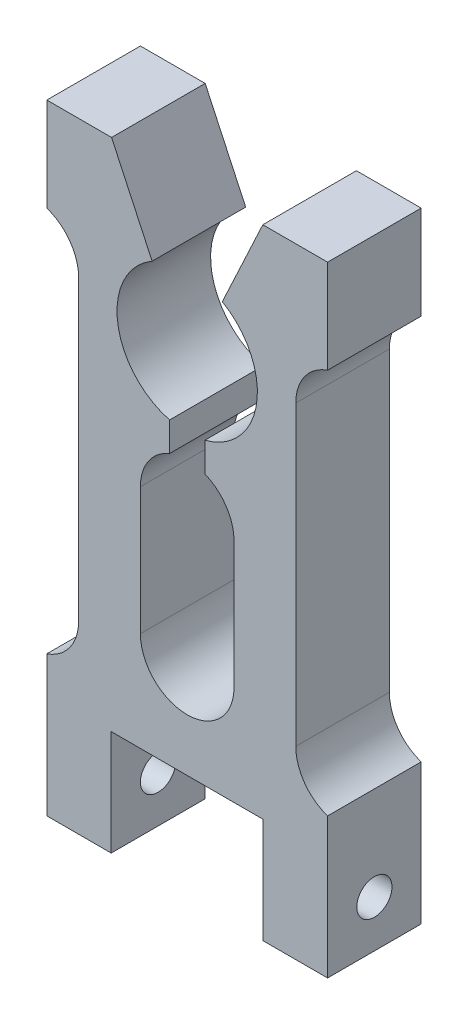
ISO-10303-21;
HEADER;
FILE_DESCRIPTION(('STEP AP214'),'2;1');
FILE_NAME('part.step','',(''),(''),'','','');
FILE_SCHEMA(('AUTOMOTIVE_DESIGN { 1 0 10303 214 1 1 1 1 }'));
ENDSEC;
DATA;
#1=APPLICATION_CONTEXT('core data for automotive mechanical design processes');
#2=APPLICATION_PROTOCOL_DEFINITION('international standard','automotive_design',2000,#1);
#3=PRODUCT_CONTEXT('',#1,'mechanical');
#4=PRODUCT('Part','Part','',(#3));
#5=PRODUCT_RELATED_PRODUCT_CATEGORY('part','',(#4));
#6=PRODUCT_DEFINITION_FORMATION('','',#4);
#7=PRODUCT_DEFINITION_CONTEXT('part definition',#1,'design');
#8=PRODUCT_DEFINITION('design','',#6,#7);
#9=PRODUCT_DEFINITION_SHAPE('','',#8);
#10=(LENGTH_UNIT() NAMED_UNIT(*) SI_UNIT(.MILLI.,.METRE.));
#11=(NAMED_UNIT(*) PLANE_ANGLE_UNIT() SI_UNIT($,.RADIAN.));
#12=(NAMED_UNIT(*) SI_UNIT($,.STERADIAN.) SOLID_ANGLE_UNIT());
#13=UNCERTAINTY_MEASURE_WITH_UNIT(LENGTH_MEASURE(1.E-05),#10,'distance_accuracy_value','');
#14=(GEOMETRIC_REPRESENTATION_CONTEXT(3) GLOBAL_UNCERTAINTY_ASSIGNED_CONTEXT((#13)) GLOBAL_UNIT_ASSIGNED_CONTEXT((#10,
#11,#12)) REPRESENTATION_CONTEXT('',''));
#15=CARTESIAN_POINT('',(0.,0.,0.));
#16=DIRECTION('',(0.,0.,1.));
#17=DIRECTION('',(1.,0.,0.));
#18=AXIS2_PLACEMENT_3D('',#15,#16,#17);
#19=CARTESIAN_POINT('',(-10.3124,-64.0842,6.35));
#20=DIRECTION('',(-1.,0.,0.));
#21=DIRECTION('',(0.,0.,1.));
#22=AXIS2_PLACEMENT_3D('',#19,#20,#21);
#23=PLANE('',#22);
#24=CARTESIAN_POINT('',(-10.3124,-57.7342,0.));
#25=DIRECTION('',(-1.,0.,0.));
#26=DIRECTION('',(0.,0.,1.));
#27=AXIS2_PLACEMENT_3D('',#24,#25,#26);
#28=CIRCLE('',#27,2.3876);
#29=CARTESIAN_POINT('',(-10.3124,-57.7342,-2.3876));
#30=VERTEX_POINT('',#29);
#31=EDGE_CURVE('E253',#30,#30,#28,.T.);
#32=ORIENTED_EDGE('',*,*,#31,.T.);
#33=EDGE_LOOP('',(#32));
#34=FACE_BOUND('',#33,.T.);
#35=DIRECTION('',(0.,1.,0.));
#36=VECTOR('',#35,1.);
#37=CARTESIAN_POINT('',(-10.3124,-64.0842,-6.35));
#38=LINE('',#37,#36);
#39=CARTESIAN_POINT('',(-10.3124,-64.0842,-6.35));
#40=VERTEX_POINT('',#39);
#41=CARTESIAN_POINT('',(-10.3124,-49.8094,-6.35));
#42=VERTEX_POINT('',#41);
#43=EDGE_CURVE('E249',#40,#42,#38,.T.);
#44=ORIENTED_EDGE('',*,*,#43,.T.);
#45=DIRECTION('',(0.,0.,-1.));
#46=VECTOR('',#45,1.);
#47=CARTESIAN_POINT('',(-10.3124,-49.8094,6.35));
#48=LINE('',#47,#46);
#49=CARTESIAN_POINT('',(-10.3124,-49.8094,6.35));
#50=VERTEX_POINT('',#49);
#51=EDGE_CURVE('E11',#50,#42,#48,.T.);
#52=ORIENTED_EDGE('',*,*,#51,.F.);
#53=DIRECTION('',(0.,1.,0.));
#54=VECTOR('',#53,1.);
#55=CARTESIAN_POINT('',(-10.3124,-64.0842,6.35));
#56=LINE('',#55,#54);
#57=CARTESIAN_POINT('',(-10.3124,-64.0842,6.35));
#58=VERTEX_POINT('',#57);
#59=EDGE_CURVE('E304',#58,#50,#56,.T.);
#60=ORIENTED_EDGE('',*,*,#59,.F.);
#61=DIRECTION('',(0.,0.,-1.));
#62=VECTOR('',#61,1.);
#63=CARTESIAN_POINT('',(-10.3124,-64.0842,6.35));
#64=LINE('',#63,#62);
#65=EDGE_CURVE('E245',#58,#40,#64,.T.);
#66=ORIENTED_EDGE('',*,*,#65,.T.);
#67=EDGE_LOOP('',(#44,#52,#60,#66));
#68=FACE_BOUND('',#67,.T.);
#69=ADVANCED_FACE('F32',(#34,#68),#23,.F.);
#70=CARTESIAN_POINT('',(-10.3124,-49.8094,6.35));
#71=DIRECTION('',(0.,1.,0.));
#72=DIRECTION('',(0.,0.,1.));
#73=AXIS2_PLACEMENT_3D('',#70,#71,#72);
#74=PLANE('',#73);
#75=DIRECTION('',(1.,0.,0.));
#76=VECTOR('',#75,1.);
#77=CARTESIAN_POINT('',(-10.3124,-49.8094,-6.35));
#78=LINE('',#77,#76);
#79=CARTESIAN_POINT('',(10.3124,-49.8094,-6.35));
#80=VERTEX_POINT('',#79);
#81=EDGE_CURVE('E252',#42,#80,#78,.T.);
#82=ORIENTED_EDGE('',*,*,#81,.T.);
#83=DIRECTION('',(0.,0.,-1.));
#84=VECTOR('',#83,1.);
#85=CARTESIAN_POINT('',(10.3124,-49.8094,6.35));
#86=LINE('',#85,#84);
#87=CARTESIAN_POINT('',(10.3124,-49.8094,6.35));
#88=VERTEX_POINT('',#87);
#89=EDGE_CURVE('E41',#88,#80,#86,.T.);
#90=ORIENTED_EDGE('',*,*,#89,.F.);
#91=DIRECTION('',(1.,0.,0.));
#92=VECTOR('',#91,1.);
#93=CARTESIAN_POINT('',(-10.3124,-49.8094,6.35));
#94=LINE('',#93,#92);
#95=EDGE_CURVE('E152',#50,#88,#94,.T.);
#96=ORIENTED_EDGE('',*,*,#95,.F.);
#97=ORIENTED_EDGE('',*,*,#51,.T.);
#98=EDGE_LOOP('',(#82,#90,#96,#97));
#99=FACE_BOUND('',#98,.T.);
#100=ADVANCED_FACE('F464',(#99),#74,.F.);
#101=CARTESIAN_POINT('',(10.3124,-49.8094,6.35));
#102=DIRECTION('',(1.,0.,0.));
#103=DIRECTION('',(0.,0.,-1.));
#104=AXIS2_PLACEMENT_3D('',#101,#102,#103);
#105=PLANE('',#104);
#106=CARTESIAN_POINT('',(10.3124,-57.7342,0.));
#107=DIRECTION('',(1.,0.,0.));
#108=DIRECTION('',(0.,0.,-1.));
#109=AXIS2_PLACEMENT_3D('',#106,#107,#108);
#110=CIRCLE('',#109,2.3876);
#111=CARTESIAN_POINT('',(10.3124,-57.7342,-2.3876));
#112=VERTEX_POINT('',#111);
#113=EDGE_CURVE('E472',#112,#112,#110,.T.);
#114=ORIENTED_EDGE('',*,*,#113,.T.);
#115=EDGE_LOOP('',(#114));
#116=FACE_BOUND('',#115,.T.);
#117=DIRECTION('',(0.,-1.,0.));
#118=VECTOR('',#117,1.);
#119=CARTESIAN_POINT('',(10.3124,-49.8094,-6.35));
#120=LINE('',#119,#118);
#121=CARTESIAN_POINT('',(10.3124,-64.0842,-6.35));
#122=VERTEX_POINT('',#121);
#123=EDGE_CURVE('E255',#80,#122,#120,.T.);
#124=ORIENTED_EDGE('',*,*,#123,.T.);
#125=DIRECTION('',(0.,0.,-1.));
#126=VECTOR('',#125,1.);
#127=CARTESIAN_POINT('',(10.3124,-64.0842,6.35));
#128=LINE('',#127,#126);
#129=CARTESIAN_POINT('',(10.3124,-64.0842,6.35));
#130=VERTEX_POINT('',#129);
#131=EDGE_CURVE('E371',#130,#122,#128,.T.);
#132=ORIENTED_EDGE('',*,*,#131,.F.);
#133=DIRECTION('',(0.,-1.,0.));
#134=VECTOR('',#133,1.);
#135=CARTESIAN_POINT('',(10.3124,-49.8094,6.35));
#136=LINE('',#135,#134);
#137=EDGE_CURVE('E380',#88,#130,#136,.T.);
#138=ORIENTED_EDGE('',*,*,#137,.F.);
#139=ORIENTED_EDGE('',*,*,#89,.T.);
#140=EDGE_LOOP('',(#124,#132,#138,#139));
#141=FACE_BOUND('',#140,.T.);
#142=ADVANCED_FACE('F378',(#116,#141),#105,.F.);
#143=CARTESIAN_POINT('',(10.3124,-64.0842,6.35));
#144=DIRECTION('',(0.,1.,0.));
#145=DIRECTION('',(0.,0.,1.));
#146=AXIS2_PLACEMENT_3D('',#143,#144,#145);
#147=PLANE('',#146);
#148=DIRECTION('',(1.,0.,0.));
#149=VECTOR('',#148,1.);
#150=CARTESIAN_POINT('',(10.3124,-64.0842,-6.35));
#151=LINE('',#150,#149);
#152=CARTESIAN_POINT('',(19.05,-64.0842,-6.35));
#153=VERTEX_POINT('',#152);
#154=EDGE_CURVE('E257',#122,#153,#151,.T.);
#155=ORIENTED_EDGE('',*,*,#154,.T.);
#156=DIRECTION('',(0.,0.,-1.));
#157=VECTOR('',#156,1.);
#158=CARTESIAN_POINT('',(19.05,-64.0842,6.35));
#159=LINE('',#158,#157);
#160=CARTESIAN_POINT('',(19.05,-64.0842,6.35));
#161=VERTEX_POINT('',#160);
#162=EDGE_CURVE('E368',#161,#153,#159,.T.);
#163=ORIENTED_EDGE('',*,*,#162,.F.);
#164=DIRECTION('',(1.,0.,0.));
#165=VECTOR('',#164,1.);
#166=CARTESIAN_POINT('',(10.3124,-64.0842,6.35));
#167=LINE('',#166,#165);
#168=EDGE_CURVE('E398',#130,#161,#167,.T.);
#169=ORIENTED_EDGE('',*,*,#168,.F.);
#170=ORIENTED_EDGE('',*,*,#131,.T.);
#171=EDGE_LOOP('',(#155,#163,#169,#170));
#172=FACE_BOUND('',#171,.T.);
#173=ADVANCED_FACE('F389',(#172),#147,.F.);
#174=CARTESIAN_POINT('',(19.05,-45.0342,6.35));
#175=DIRECTION('',(-1.,0.,0.));
#176=DIRECTION('',(0.,0.,1.));
#177=AXIS2_PLACEMENT_3D('',#174,#175,#176);
#178=PLANE('',#177);
#179=CARTESIAN_POINT('',(19.05,-57.7342,0.));
#180=DIRECTION('',(-1.,0.,0.));
#181=DIRECTION('',(0.,0.,1.));
#182=AXIS2_PLACEMENT_3D('',#179,#180,#181);
#183=CIRCLE('',#182,2.3876);
#184=CARTESIAN_POINT('',(19.05,-57.7342,-2.3876));
#185=VERTEX_POINT('',#184);
#186=EDGE_CURVE('E475',#185,#185,#183,.T.);
#187=ORIENTED_EDGE('',*,*,#186,.T.);
#188=EDGE_LOOP('',(#187));
#189=FACE_BOUND('',#188,.T.);
#190=DIRECTION('',(0.,1.,0.));
#191=VECTOR('',#190,1.);
#192=CARTESIAN_POINT('',(19.05,-45.0342,-6.35));
#193=LINE('',#192,#191);
#194=CARTESIAN_POINT('',(19.05,-45.0342,-6.35));
#195=VERTEX_POINT('',#194);
#196=EDGE_CURVE('E259',#153,#195,#193,.T.);
#197=ORIENTED_EDGE('',*,*,#196,.T.);
#198=DIRECTION('',(0.,0.,-1.));
#199=VECTOR('',#198,1.);
#200=CARTESIAN_POINT('',(19.05,-45.0342,6.35));
#201=LINE('',#200,#199);
#202=CARTESIAN_POINT('',(19.05,-45.0342,6.35));
#203=VERTEX_POINT('',#202);
#204=EDGE_CURVE('E365',#203,#195,#201,.T.);
#205=ORIENTED_EDGE('',*,*,#204,.F.);
#206=DIRECTION('',(0.,1.,0.));
#207=VECTOR('',#206,1.);
#208=CARTESIAN_POINT('',(19.05,-45.0342,6.35));
#209=LINE('',#208,#207);
#210=EDGE_CURVE('E395',#161,#203,#209,.T.);
#211=ORIENTED_EDGE('',*,*,#210,.F.);
#212=ORIENTED_EDGE('',*,*,#162,.T.);
#213=EDGE_LOOP('',(#197,#205,#211,#212));
#214=FACE_BOUND('',#213,.T.);
#215=ADVANCED_FACE('F393',(#189,#214),#178,.F.);
#216=CARTESIAN_POINT('',(21.082,-39.0180986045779,6.35));
#217=DIRECTION('',(0.,0.,-1.));
#218=DIRECTION('',(-1.,0.,0.));
#219=AXIS2_PLACEMENT_3D('',#216,#217,#218);
#220=CYLINDRICAL_SURFACE('',#219,6.35);
#221=CARTESIAN_POINT('',(21.082,-39.0180986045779,-6.35));
#222=DIRECTION('',(0.,0.,-1.));
#223=DIRECTION('',(1.,0.,0.));
#224=AXIS2_PLACEMENT_3D('',#221,#222,#223);
#225=CIRCLE('',#224,6.35);
#226=CARTESIAN_POINT('',(14.732,-39.0180986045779,-6.35));
#227=VERTEX_POINT('',#226);
#228=EDGE_CURVE('E261',#195,#227,#225,.T.);
#229=ORIENTED_EDGE('',*,*,#228,.T.);
#230=DIRECTION('',(0.,0.,-1.));
#231=VECTOR('',#230,1.);
#232=CARTESIAN_POINT('',(14.732,-39.0180986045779,6.35));
#233=LINE('',#232,#231);
#234=CARTESIAN_POINT('',(14.732,-39.0180986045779,6.35));
#235=VERTEX_POINT('',#234);
#236=EDGE_CURVE('E362',#235,#227,#233,.T.);
#237=ORIENTED_EDGE('',*,*,#236,.F.);
#238=CARTESIAN_POINT('',(21.082,-39.0180986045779,6.35));
#239=DIRECTION('',(0.,0.,-1.));
#240=DIRECTION('',(1.,0.,0.));
#241=AXIS2_PLACEMENT_3D('',#238,#239,#240);
#242=CIRCLE('',#241,6.35);
#243=EDGE_CURVE('E397',#203,#235,#242,.T.);
#244=ORIENTED_EDGE('',*,*,#243,.F.);
#245=ORIENTED_EDGE('',*,*,#204,.T.);
#246=EDGE_LOOP('',(#229,#237,#244,#245));
#247=FACE_BOUND('',#246,.T.);
#248=ADVANCED_FACE('F700',(#247),#220,.F.);
#249=CARTESIAN_POINT('',(14.732,1.32449860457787,6.35));
#250=DIRECTION('',(-1.,0.,0.));
#251=DIRECTION('',(0.,-1.,0.));
#252=AXIS2_PLACEMENT_3D('',#249,#250,#251);
#253=PLANE('',#252);
#254=DIRECTION('',(0.,1.,0.));
#255=VECTOR('',#254,1.);
#256=CARTESIAN_POINT('',(14.732,1.32449860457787,-6.35));
#257=LINE('',#256,#255);
#258=CARTESIAN_POINT('',(14.732,1.32449860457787,-6.35));
#259=VERTEX_POINT('',#258);
#260=EDGE_CURVE('E263',#227,#259,#257,.T.);
#261=ORIENTED_EDGE('',*,*,#260,.T.);
#262=DIRECTION('',(0.,0.,-1.));
#263=VECTOR('',#262,1.);
#264=CARTESIAN_POINT('',(14.732,1.32449860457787,6.35));
#265=LINE('',#264,#263);
#266=CARTESIAN_POINT('',(14.732,1.32449860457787,6.35));
#267=VERTEX_POINT('',#266);
#268=EDGE_CURVE('E359',#267,#259,#265,.T.);
#269=ORIENTED_EDGE('',*,*,#268,.F.);
#270=DIRECTION('',(0.,1.,0.));
#271=VECTOR('',#270,1.);
#272=CARTESIAN_POINT('',(14.732,1.32449860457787,6.35));
#273=LINE('',#272,#271);
#274=EDGE_CURVE('E400',#235,#267,#273,.T.);
#275=ORIENTED_EDGE('',*,*,#274,.F.);
#276=ORIENTED_EDGE('',*,*,#236,.T.);
#277=EDGE_LOOP('',(#261,#269,#275,#276));
#278=FACE_BOUND('',#277,.T.);
#279=ADVANCED_FACE('F690',(#278),#253,.F.);
#280=CARTESIAN_POINT('',(21.082,1.32449860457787,6.35));
#281=DIRECTION('',(0.,0.,-1.));
#282=DIRECTION('',(-1.,0.,0.));
#283=AXIS2_PLACEMENT_3D('',#280,#281,#282);
#284=CYLINDRICAL_SURFACE('',#283,6.35);
#285=CARTESIAN_POINT('',(21.082,1.32449860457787,-6.35));
#286=DIRECTION('',(0.,0.,-1.));
#287=DIRECTION('',(1.,0.,0.));
#288=AXIS2_PLACEMENT_3D('',#285,#286,#287);
#289=CIRCLE('',#288,6.35);
#290=CARTESIAN_POINT('',(19.05,7.34059999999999,-6.35));
#291=VERTEX_POINT('',#290);
#292=EDGE_CURVE('E265',#259,#291,#289,.T.);
#293=ORIENTED_EDGE('',*,*,#292,.T.);
#294=DIRECTION('',(0.,0.,-1.));
#295=VECTOR('',#294,1.);
#296=CARTESIAN_POINT('',(19.05,7.34059999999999,6.35));
#297=LINE('',#296,#295);
#298=CARTESIAN_POINT('',(19.05,7.34059999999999,6.35));
#299=VERTEX_POINT('',#298);
#300=EDGE_CURVE('E356',#299,#291,#297,.T.);
#301=ORIENTED_EDGE('',*,*,#300,.F.);
#302=CARTESIAN_POINT('',(21.082,1.32449860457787,6.35));
#303=DIRECTION('',(0.,0.,-1.));
#304=DIRECTION('',(1.,0.,0.));
#305=AXIS2_PLACEMENT_3D('',#302,#303,#304);
#306=CIRCLE('',#305,6.35);
#307=EDGE_CURVE('E406',#267,#299,#306,.T.);
#308=ORIENTED_EDGE('',*,*,#307,.F.);
#309=ORIENTED_EDGE('',*,*,#268,.T.);
#310=EDGE_LOOP('',(#293,#301,#308,#309));
#311=FACE_BOUND('',#310,.T.);
#312=ADVANCED_FACE('F680',(#311),#284,.F.);
#313=CARTESIAN_POINT('',(19.05,20.0406,6.35));
#314=DIRECTION('',(-1.,0.,0.));
#315=DIRECTION('',(0.,-1.,0.));
#316=AXIS2_PLACEMENT_3D('',#313,#314,#315);
#317=PLANE('',#316);
#318=DIRECTION('',(0.,1.,0.));
#319=VECTOR('',#318,1.);
#320=CARTESIAN_POINT('',(19.05,20.0406,-6.35));
#321=LINE('',#320,#319);
#322=CARTESIAN_POINT('',(19.05,20.0406,-6.35));
#323=VERTEX_POINT('',#322);
#324=EDGE_CURVE('E267',#291,#323,#321,.T.);
#325=ORIENTED_EDGE('',*,*,#324,.T.);
#326=DIRECTION('',(0.,0.,-1.));
#327=VECTOR('',#326,1.);
#328=CARTESIAN_POINT('',(19.05,20.0406,6.35));
#329=LINE('',#328,#327);
#330=CARTESIAN_POINT('',(19.05,20.0406,6.35));
#331=VERTEX_POINT('',#330);
#332=EDGE_CURVE('E353',#331,#323,#329,.T.);
#333=ORIENTED_EDGE('',*,*,#332,.F.);
#334=DIRECTION('',(0.,1.,0.));
#335=VECTOR('',#334,1.);
#336=CARTESIAN_POINT('',(19.05,20.0406,6.35));
#337=LINE('',#336,#335);
#338=EDGE_CURVE('E408',#299,#331,#337,.T.);
#339=ORIENTED_EDGE('',*,*,#338,.F.);
#340=ORIENTED_EDGE('',*,*,#300,.T.);
#341=EDGE_LOOP('',(#325,#333,#339,#340));
#342=FACE_BOUND('',#341,.T.);
#343=ADVANCED_FACE('F670',(#342),#317,.F.);
#344=CARTESIAN_POINT('',(10.2610637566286,20.0406,6.35));
#345=DIRECTION('',(0.,-1.,0.));
#346=DIRECTION('',(1.,0.,0.));
#347=AXIS2_PLACEMENT_3D('',#344,#345,#346);
#348=PLANE('',#347);
#349=DIRECTION('',(-1.,0.,0.));
#350=VECTOR('',#349,1.);
#351=CARTESIAN_POINT('',(10.2610637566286,20.0406,-6.35));
#352=LINE('',#351,#350);
#353=CARTESIAN_POINT('',(10.2610637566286,20.0406,-6.35));
#354=VERTEX_POINT('',#353);
#355=EDGE_CURVE('E269',#323,#354,#352,.T.);
#356=ORIENTED_EDGE('',*,*,#355,.T.);
#357=DIRECTION('',(0.,0.,-1.));
#358=VECTOR('',#357,1.);
#359=CARTESIAN_POINT('',(10.2610637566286,20.0406,6.35));
#360=LINE('',#359,#358);
#361=CARTESIAN_POINT('',(10.2610637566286,20.0406,6.35));
#362=VERTEX_POINT('',#361);
#363=EDGE_CURVE('E350',#362,#354,#360,.T.);
#364=ORIENTED_EDGE('',*,*,#363,.F.);
#365=DIRECTION('',(-1.,0.,0.));
#366=VECTOR('',#365,1.);
#367=CARTESIAN_POINT('',(10.2610637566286,20.0406,6.35));
#368=LINE('',#367,#366);
#369=EDGE_CURVE('E410',#331,#362,#368,.T.);
#370=ORIENTED_EDGE('',*,*,#369,.F.);
#371=ORIENTED_EDGE('',*,*,#332,.T.);
#372=EDGE_LOOP('',(#356,#364,#370,#371));
#373=FACE_BOUND('',#372,.T.);
#374=ADVANCED_FACE('F660',(#373),#348,.F.);
#375=CARTESIAN_POINT('',(4.7625,8.24889197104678,6.35));
#376=DIRECTION('',(0.906307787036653,-0.422618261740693,0.));
#377=DIRECTION('',(0.422618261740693,0.906307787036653,0.));
#378=AXIS2_PLACEMENT_3D('',#375,#376,#377);
#379=PLANE('',#378);
#380=DIRECTION('',(-0.422618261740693,-0.906307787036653,0.));
#381=VECTOR('',#380,1.);
#382=CARTESIAN_POINT('',(4.7625,8.24889197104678,-6.35));
#383=LINE('',#382,#381);
#384=CARTESIAN_POINT('',(4.7625,8.24889197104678,-6.35));
#385=VERTEX_POINT('',#384);
#386=EDGE_CURVE('E271',#354,#385,#383,.T.);
#387=ORIENTED_EDGE('',*,*,#386,.T.);
#388=DIRECTION('',(0.,0.,-1.));
#389=VECTOR('',#388,1.);
#390=CARTESIAN_POINT('',(4.7625,8.24889197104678,6.35));
#391=LINE('',#390,#389);
#392=CARTESIAN_POINT('',(4.7625,8.24889197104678,6.35));
#393=VERTEX_POINT('',#392);
#394=EDGE_CURVE('E347',#393,#385,#391,.T.);
#395=ORIENTED_EDGE('',*,*,#394,.F.);
#396=DIRECTION('',(-0.422618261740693,-0.906307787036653,0.));
#397=VECTOR('',#396,1.);
#398=CARTESIAN_POINT('',(4.7625,8.24889197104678,6.35));
#399=LINE('',#398,#397);
#400=EDGE_CURVE('E412',#362,#393,#399,.T.);
#401=ORIENTED_EDGE('',*,*,#400,.F.);
#402=ORIENTED_EDGE('',*,*,#363,.T.);
#403=EDGE_LOOP('',(#387,#395,#401,#402));
#404=FACE_BOUND('',#403,.T.);
#405=ADVANCED_FACE('F650',(#404),#379,.F.);
#406=CARTESIAN_POINT('',(0.,0.,6.35));
#407=DIRECTION('',(0.,0.,-1.));
#408=DIRECTION('',(-1.,0.,0.));
#409=AXIS2_PLACEMENT_3D('',#406,#407,#408);
#410=CYLINDRICAL_SURFACE('',#409,9.525);
#411=CARTESIAN_POINT('',(0.,0.,-6.35));
#412=DIRECTION('',(0.,0.,-1.));
#413=DIRECTION('',(1.,0.,0.));
#414=AXIS2_PLACEMENT_3D('',#411,#412,#413);
#415=CIRCLE('',#414,9.525);
#416=CARTESIAN_POINT('',(2.3876,-9.22089969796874,-6.35));
#417=VERTEX_POINT('',#416);
#418=EDGE_CURVE('E273',#385,#417,#415,.T.);
#419=ORIENTED_EDGE('',*,*,#418,.T.);
#420=DIRECTION('',(0.,0.,-1.));
#421=VECTOR('',#420,1.);
#422=CARTESIAN_POINT('',(2.3876,-9.22089969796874,6.35));
#423=LINE('',#422,#421);
#424=CARTESIAN_POINT('',(2.3876,-9.22089969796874,6.35));
#425=VERTEX_POINT('',#424);
#426=EDGE_CURVE('E344',#425,#417,#423,.T.);
#427=ORIENTED_EDGE('',*,*,#426,.F.);
#428=CARTESIAN_POINT('',(0.,0.,6.35));
#429=DIRECTION('',(0.,0.,-1.));
#430=DIRECTION('',(1.,0.,0.));
#431=AXIS2_PLACEMENT_3D('',#428,#429,#430);
#432=CIRCLE('',#431,9.525);
#433=EDGE_CURVE('E414',#393,#425,#432,.T.);
#434=ORIENTED_EDGE('',*,*,#433,.F.);
#435=ORIENTED_EDGE('',*,*,#394,.T.);
#436=EDGE_LOOP('',(#419,#427,#434,#435));
#437=FACE_BOUND('',#436,.T.);
#438=ADVANCED_FACE('F640',(#437),#410,.F.);
#439=CARTESIAN_POINT('',(2.3876,-13.1659651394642,6.35));
#440=DIRECTION('',(1.,0.,0.));
#441=DIRECTION('',(0.,0.,-1.));
#442=AXIS2_PLACEMENT_3D('',#439,#440,#441);
#443=PLANE('',#442);
#444=DIRECTION('',(0.,-1.,0.));
#445=VECTOR('',#444,1.);
#446=CARTESIAN_POINT('',(2.3876,-13.1659651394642,-6.35));
#447=LINE('',#446,#445);
#448=CARTESIAN_POINT('',(2.3876,-13.1659651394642,-6.35));
#449=VERTEX_POINT('',#448);
#450=EDGE_CURVE('E275',#417,#449,#447,.T.);
#451=ORIENTED_EDGE('',*,*,#450,.T.);
#452=DIRECTION('',(0.,0.,-1.));
#453=VECTOR('',#452,1.);
#454=CARTESIAN_POINT('',(2.3876,-13.1659651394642,6.35));
#455=LINE('',#454,#453);
#456=CARTESIAN_POINT('',(2.3876,-13.1659651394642,6.35));
#457=VERTEX_POINT('',#456);
#458=EDGE_CURVE('E341',#457,#449,#455,.T.);
#459=ORIENTED_EDGE('',*,*,#458,.F.);
#460=DIRECTION('',(0.,-1.,0.));
#461=VECTOR('',#460,1.);
#462=CARTESIAN_POINT('',(2.3876,-13.1659651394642,6.35));
#463=LINE('',#462,#461);
#464=EDGE_CURVE('E416',#425,#457,#463,.T.);
#465=ORIENTED_EDGE('',*,*,#464,.F.);
#466=ORIENTED_EDGE('',*,*,#426,.T.);
#467=EDGE_LOOP('',(#451,#459,#465,#466));
#468=FACE_BOUND('',#467,.T.);
#469=ADVANCED_FACE('F630',(#468),#443,.F.);
#470=CARTESIAN_POINT('',(0.,-19.05,6.35));
#471=DIRECTION('',(0.,0.,-1.));
#472=DIRECTION('',(-1.,0.,0.));
#473=AXIS2_PLACEMENT_3D('',#470,#471,#472);
#474=CYLINDRICAL_SURFACE('',#473,6.35);
#475=CARTESIAN_POINT('',(0.,-19.05,-6.35));
#476=DIRECTION('',(0.,0.,-1.));
#477=DIRECTION('',(1.,0.,0.));
#478=AXIS2_PLACEMENT_3D('',#475,#476,#477);
#479=CIRCLE('',#478,6.35);
#480=CARTESIAN_POINT('',(6.35,-19.05,-6.35));
#481=VERTEX_POINT('',#480);
#482=EDGE_CURVE('E277',#449,#481,#479,.T.);
#483=ORIENTED_EDGE('',*,*,#482,.T.);
#484=DIRECTION('',(0.,0.,-1.));
#485=VECTOR('',#484,1.);
#486=CARTESIAN_POINT('',(6.35,-19.05,6.35));
#487=LINE('',#486,#485);
#488=CARTESIAN_POINT('',(6.35,-19.05,6.35));
#489=VERTEX_POINT('',#488);
#490=EDGE_CURVE('E338',#489,#481,#487,.T.);
#491=ORIENTED_EDGE('',*,*,#490,.F.);
#492=CARTESIAN_POINT('',(0.,-19.05,6.35));
#493=DIRECTION('',(0.,0.,-1.));
#494=DIRECTION('',(1.,0.,0.));
#495=AXIS2_PLACEMENT_3D('',#492,#493,#494);
#496=CIRCLE('',#495,6.35);
#497=EDGE_CURVE('E418',#457,#489,#496,.T.);
#498=ORIENTED_EDGE('',*,*,#497,.F.);
#499=ORIENTED_EDGE('',*,*,#458,.T.);
#500=EDGE_LOOP('',(#483,#491,#498,#499));
#501=FACE_BOUND('',#500,.T.);
#502=ADVANCED_FACE('F620',(#501),#474,.F.);
#503=CARTESIAN_POINT('',(6.35,-36.322,6.35));
#504=DIRECTION('',(1.,0.,0.));
#505=DIRECTION('',(0.,0.,-1.));
#506=AXIS2_PLACEMENT_3D('',#503,#504,#505);
#507=PLANE('',#506);
#508=DIRECTION('',(0.,-1.,0.));
#509=VECTOR('',#508,1.);
#510=CARTESIAN_POINT('',(6.35,-36.322,-6.35));
#511=LINE('',#510,#509);
#512=CARTESIAN_POINT('',(6.35,-36.322,-6.35));
#513=VERTEX_POINT('',#512);
#514=EDGE_CURVE('E279',#481,#513,#511,.T.);
#515=ORIENTED_EDGE('',*,*,#514,.T.);
#516=DIRECTION('',(0.,0.,-1.));
#517=VECTOR('',#516,1.);
#518=CARTESIAN_POINT('',(6.35,-36.322,6.35));
#519=LINE('',#518,#517);
#520=CARTESIAN_POINT('',(6.35,-36.322,6.35));
#521=VERTEX_POINT('',#520);
#522=EDGE_CURVE('E335',#521,#513,#519,.T.);
#523=ORIENTED_EDGE('',*,*,#522,.F.);
#524=DIRECTION('',(0.,-1.,0.));
#525=VECTOR('',#524,1.);
#526=CARTESIAN_POINT('',(6.35,-36.322,6.35));
#527=LINE('',#526,#525);
#528=EDGE_CURVE('E420',#489,#521,#527,.T.);
#529=ORIENTED_EDGE('',*,*,#528,.F.);
#530=ORIENTED_EDGE('',*,*,#490,.T.);
#531=EDGE_LOOP('',(#515,#523,#529,#530));
#532=FACE_BOUND('',#531,.T.);
#533=ADVANCED_FACE('F610',(#532),#507,.F.);
#534=CARTESIAN_POINT('',(0.,-36.322,6.35));
#535=DIRECTION('',(0.,0.,-1.));
#536=DIRECTION('',(-1.,0.,0.));
#537=AXIS2_PLACEMENT_3D('',#534,#535,#536);
#538=CYLINDRICAL_SURFACE('',#537,6.35);
#539=CARTESIAN_POINT('',(0.,-36.322,-6.35));
#540=DIRECTION('',(0.,0.,-1.));
#541=DIRECTION('',(1.,0.,0.));
#542=AXIS2_PLACEMENT_3D('',#539,#540,#541);
#543=CIRCLE('',#542,6.35);
#544=CARTESIAN_POINT('',(-6.35,-36.322,-6.35));
#545=VERTEX_POINT('',#544);
#546=EDGE_CURVE('E281',#513,#545,#543,.T.);
#547=ORIENTED_EDGE('',*,*,#546,.T.);
#548=DIRECTION('',(0.,0.,-1.));
#549=VECTOR('',#548,1.);
#550=CARTESIAN_POINT('',(-6.35,-36.322,6.35));
#551=LINE('',#550,#549);
#552=CARTESIAN_POINT('',(-6.35,-36.322,6.35));
#553=VERTEX_POINT('',#552);
#554=EDGE_CURVE('E332',#553,#545,#551,.T.);
#555=ORIENTED_EDGE('',*,*,#554,.F.);
#556=CARTESIAN_POINT('',(0.,-36.322,6.35));
#557=DIRECTION('',(0.,0.,-1.));
#558=DIRECTION('',(1.,0.,0.));
#559=AXIS2_PLACEMENT_3D('',#556,#557,#558);
#560=CIRCLE('',#559,6.35);
#561=EDGE_CURVE('E422',#521,#553,#560,.T.);
#562=ORIENTED_EDGE('',*,*,#561,.F.);
#563=ORIENTED_EDGE('',*,*,#522,.T.);
#564=EDGE_LOOP('',(#547,#555,#562,#563));
#565=FACE_BOUND('',#564,.T.);
#566=ADVANCED_FACE('F600',(#565),#538,.F.);
#567=CARTESIAN_POINT('',(-6.35,-36.322,6.35));
#568=DIRECTION('',(-1.,0.,0.));
#569=DIRECTION('',(0.,0.,1.));
#570=AXIS2_PLACEMENT_3D('',#567,#568,#569);
#571=PLANE('',#570);
#572=DIRECTION('',(0.,1.,0.));
#573=VECTOR('',#572,1.);
#574=CARTESIAN_POINT('',(-6.35,-36.322,-6.35));
#575=LINE('',#574,#573);
#576=CARTESIAN_POINT('',(-6.35,-19.05,-6.35));
#577=VERTEX_POINT('',#576);
#578=EDGE_CURVE('E283',#545,#577,#575,.T.);
#579=ORIENTED_EDGE('',*,*,#578,.T.);
#580=DIRECTION('',(0.,0.,-1.));
#581=VECTOR('',#580,1.);
#582=CARTESIAN_POINT('',(-6.35,-19.05,6.35));
#583=LINE('',#582,#581);
#584=CARTESIAN_POINT('',(-6.35,-19.05,6.35));
#585=VERTEX_POINT('',#584);
#586=EDGE_CURVE('E329',#585,#577,#583,.T.);
#587=ORIENTED_EDGE('',*,*,#586,.F.);
#588=DIRECTION('',(0.,1.,0.));
#589=VECTOR('',#588,1.);
#590=CARTESIAN_POINT('',(-6.35,-36.322,6.35));
#591=LINE('',#590,#589);
#592=EDGE_CURVE('E424',#553,#585,#591,.T.);
#593=ORIENTED_EDGE('',*,*,#592,.F.);
#594=ORIENTED_EDGE('',*,*,#554,.T.);
#595=EDGE_LOOP('',(#579,#587,#593,#594));
#596=FACE_BOUND('',#595,.T.);
#597=ADVANCED_FACE('F590',(#596),#571,.F.);
#598=CARTESIAN_POINT('',(0.,-19.05,6.35));
#599=DIRECTION('',(0.,0.,-1.));
#600=DIRECTION('',(-1.,0.,0.));
#601=AXIS2_PLACEMENT_3D('',#598,#599,#600);
#602=CYLINDRICAL_SURFACE('',#601,6.35);
#603=CARTESIAN_POINT('',(0.,-19.05,-6.35));
#604=DIRECTION('',(0.,0.,-1.));
#605=DIRECTION('',(1.,0.,0.));
#606=AXIS2_PLACEMENT_3D('',#603,#604,#605);
#607=CIRCLE('',#606,6.35);
#608=CARTESIAN_POINT('',(-2.3876,-13.1659651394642,-6.35));
#609=VERTEX_POINT('',#608);
#610=EDGE_CURVE('E285',#577,#609,#607,.T.);
#611=ORIENTED_EDGE('',*,*,#610,.T.);
#612=DIRECTION('',(0.,0.,-1.));
#613=VECTOR('',#612,1.);
#614=CARTESIAN_POINT('',(-2.3876,-13.1659651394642,6.35));
#615=LINE('',#614,#613);
#616=CARTESIAN_POINT('',(-2.3876,-13.1659651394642,6.35));
#617=VERTEX_POINT('',#616);
#618=EDGE_CURVE('E326',#617,#609,#615,.T.);
#619=ORIENTED_EDGE('',*,*,#618,.F.);
#620=CARTESIAN_POINT('',(0.,-19.05,6.35));
#621=DIRECTION('',(0.,0.,-1.));
#622=DIRECTION('',(1.,0.,0.));
#623=AXIS2_PLACEMENT_3D('',#620,#621,#622);
#624=CIRCLE('',#623,6.35);
#625=EDGE_CURVE('E426',#585,#617,#624,.T.);
#626=ORIENTED_EDGE('',*,*,#625,.F.);
#627=ORIENTED_EDGE('',*,*,#586,.T.);
#628=EDGE_LOOP('',(#611,#619,#626,#627));
#629=FACE_BOUND('',#628,.T.);
#630=ADVANCED_FACE('F580',(#629),#602,.F.);
#631=CARTESIAN_POINT('',(-2.3876,-13.1659651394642,6.35));
#632=DIRECTION('',(-1.,0.,0.));
#633=DIRECTION('',(0.,0.,1.));
#634=AXIS2_PLACEMENT_3D('',#631,#632,#633);
#635=PLANE('',#634);
#636=DIRECTION('',(0.,1.,0.));
#637=VECTOR('',#636,1.);
#638=CARTESIAN_POINT('',(-2.3876,-13.1659651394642,-6.35));
#639=LINE('',#638,#637);
#640=CARTESIAN_POINT('',(-2.3876,-9.22089969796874,-6.35));
#641=VERTEX_POINT('',#640);
#642=EDGE_CURVE('E287',#609,#641,#639,.T.);
#643=ORIENTED_EDGE('',*,*,#642,.T.);
#644=DIRECTION('',(0.,0.,-1.));
#645=VECTOR('',#644,1.);
#646=CARTESIAN_POINT('',(-2.3876,-9.22089969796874,6.35));
#647=LINE('',#646,#645);
#648=CARTESIAN_POINT('',(-2.3876,-9.22089969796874,6.35));
#649=VERTEX_POINT('',#648);
#650=EDGE_CURVE('E323',#649,#641,#647,.T.);
#651=ORIENTED_EDGE('',*,*,#650,.F.);
#652=DIRECTION('',(0.,1.,0.));
#653=VECTOR('',#652,1.);
#654=CARTESIAN_POINT('',(-2.3876,-13.1659651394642,6.35));
#655=LINE('',#654,#653);
#656=EDGE_CURVE('E428',#617,#649,#655,.T.);
#657=ORIENTED_EDGE('',*,*,#656,.F.);
#658=ORIENTED_EDGE('',*,*,#618,.T.);
#659=EDGE_LOOP('',(#643,#651,#657,#658));
#660=FACE_BOUND('',#659,.T.);
#661=ADVANCED_FACE('F570',(#660),#635,.F.);
#662=CARTESIAN_POINT('',(0.,0.,6.35));
#663=DIRECTION('',(0.,0.,-1.));
#664=DIRECTION('',(-1.,0.,0.));
#665=AXIS2_PLACEMENT_3D('',#662,#663,#664);
#666=CYLINDRICAL_SURFACE('',#665,9.525);
#667=CARTESIAN_POINT('',(0.,0.,-6.35));
#668=DIRECTION('',(0.,0.,-1.));
#669=DIRECTION('',(1.,0.,0.));
#670=AXIS2_PLACEMENT_3D('',#667,#668,#669);
#671=CIRCLE('',#670,9.525);
#672=CARTESIAN_POINT('',(-4.7625,8.24889197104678,-6.35));
#673=VERTEX_POINT('',#672);
#674=EDGE_CURVE('E289',#641,#673,#671,.T.);
#675=ORIENTED_EDGE('',*,*,#674,.T.);
#676=DIRECTION('',(0.,0.,-1.));
#677=VECTOR('',#676,1.);
#678=CARTESIAN_POINT('',(-4.7625,8.24889197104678,6.35));
#679=LINE('',#678,#677);
#680=CARTESIAN_POINT('',(-4.7625,8.24889197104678,6.35));
#681=VERTEX_POINT('',#680);
#682=EDGE_CURVE('E320',#681,#673,#679,.T.);
#683=ORIENTED_EDGE('',*,*,#682,.F.);
#684=CARTESIAN_POINT('',(0.,0.,6.35));
#685=DIRECTION('',(0.,0.,-1.));
#686=DIRECTION('',(1.,0.,0.));
#687=AXIS2_PLACEMENT_3D('',#684,#685,#686);
#688=CIRCLE('',#687,9.525);
#689=EDGE_CURVE('E430',#649,#681,#688,.T.);
#690=ORIENTED_EDGE('',*,*,#689,.F.);
#691=ORIENTED_EDGE('',*,*,#650,.T.);
#692=EDGE_LOOP('',(#675,#683,#690,#691));
#693=FACE_BOUND('',#692,.T.);
#694=ADVANCED_FACE('F560',(#693),#666,.F.);
#695=CARTESIAN_POINT('',(-4.7625,8.24889197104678,6.35));
#696=DIRECTION('',(-0.906307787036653,-0.422618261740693,0.));
#697=DIRECTION('',(0.422618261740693,-0.906307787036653,0.));
#698=AXIS2_PLACEMENT_3D('',#695,#696,#697);
#699=PLANE('',#698);
#700=DIRECTION('',(-0.422618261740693,0.906307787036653,0.));
#701=VECTOR('',#700,1.);
#702=CARTESIAN_POINT('',(-4.7625,8.24889197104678,-6.35));
#703=LINE('',#702,#701);
#704=CARTESIAN_POINT('',(-10.2610637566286,20.0406,-6.35));
#705=VERTEX_POINT('',#704);
#706=EDGE_CURVE('E291',#673,#705,#703,.T.);
#707=ORIENTED_EDGE('',*,*,#706,.T.);
#708=DIRECTION('',(0.,0.,-1.));
#709=VECTOR('',#708,1.);
#710=CARTESIAN_POINT('',(-10.2610637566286,20.0406,6.35));
#711=LINE('',#710,#709);
#712=CARTESIAN_POINT('',(-10.2610637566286,20.0406,6.35));
#713=VERTEX_POINT('',#712);
#714=EDGE_CURVE('E317',#713,#705,#711,.T.);
#715=ORIENTED_EDGE('',*,*,#714,.F.);
#716=DIRECTION('',(-0.422618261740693,0.906307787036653,0.));
#717=VECTOR('',#716,1.);
#718=CARTESIAN_POINT('',(-4.7625,8.24889197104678,6.35));
#719=LINE('',#718,#717);
#720=EDGE_CURVE('E432',#681,#713,#719,.T.);
#721=ORIENTED_EDGE('',*,*,#720,.F.);
#722=ORIENTED_EDGE('',*,*,#682,.T.);
#723=EDGE_LOOP('',(#707,#715,#721,#722));
#724=FACE_BOUND('',#723,.T.);
#725=ADVANCED_FACE('F550',(#724),#699,.F.);
#726=CARTESIAN_POINT('',(-10.2610637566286,20.0406,6.35));
#727=DIRECTION('',(0.,-1.,0.));
#728=DIRECTION('',(1.,0.,0.));
#729=AXIS2_PLACEMENT_3D('',#726,#727,#728);
#730=PLANE('',#729);
#731=DIRECTION('',(-1.,0.,0.));
#732=VECTOR('',#731,1.);
#733=CARTESIAN_POINT('',(-10.2610637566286,20.0406,-6.35));
#734=LINE('',#733,#732);
#735=CARTESIAN_POINT('',(-19.05,20.0406,-6.35));
#736=VERTEX_POINT('',#735);
#737=EDGE_CURVE('E293',#705,#736,#734,.T.);
#738=ORIENTED_EDGE('',*,*,#737,.T.);
#739=DIRECTION('',(0.,0.,-1.));
#740=VECTOR('',#739,1.);
#741=CARTESIAN_POINT('',(-19.05,20.0406,6.35));
#742=LINE('',#741,#740);
#743=CARTESIAN_POINT('',(-19.05,20.0406,6.35));
#744=VERTEX_POINT('',#743);
#745=EDGE_CURVE('E314',#744,#736,#742,.T.);
#746=ORIENTED_EDGE('',*,*,#745,.F.);
#747=DIRECTION('',(-1.,0.,0.));
#748=VECTOR('',#747,1.);
#749=CARTESIAN_POINT('',(-10.2610637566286,20.0406,6.35));
#750=LINE('',#749,#748);
#751=EDGE_CURVE('E434',#713,#744,#750,.T.);
#752=ORIENTED_EDGE('',*,*,#751,.F.);
#753=ORIENTED_EDGE('',*,*,#714,.T.);
#754=EDGE_LOOP('',(#738,#746,#752,#753));
#755=FACE_BOUND('',#754,.T.);
#756=ADVANCED_FACE('F540',(#755),#730,.F.);
#757=CARTESIAN_POINT('',(-19.05,20.0406,6.35));
#758=DIRECTION('',(1.,0.,0.));
#759=DIRECTION('',(0.,1.,0.));
#760=AXIS2_PLACEMENT_3D('',#757,#758,#759);
#761=PLANE('',#760);
#762=DIRECTION('',(0.,-1.,0.));
#763=VECTOR('',#762,1.);
#764=CARTESIAN_POINT('',(-19.05,20.0406,-6.35));
#765=LINE('',#764,#763);
#766=CARTESIAN_POINT('',(-19.05,7.34059999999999,-6.35));
#767=VERTEX_POINT('',#766);
#768=EDGE_CURVE('E295',#736,#767,#765,.T.);
#769=ORIENTED_EDGE('',*,*,#768,.T.);
#770=DIRECTION('',(0.,0.,-1.));
#771=VECTOR('',#770,1.);
#772=CARTESIAN_POINT('',(-19.05,7.34059999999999,6.35));
#773=LINE('',#772,#771);
#774=CARTESIAN_POINT('',(-19.05,7.34059999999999,6.35));
#775=VERTEX_POINT('',#774);
#776=EDGE_CURVE('E311',#775,#767,#773,.T.);
#777=ORIENTED_EDGE('',*,*,#776,.F.);
#778=DIRECTION('',(0.,-1.,0.));
#779=VECTOR('',#778,1.);
#780=CARTESIAN_POINT('',(-19.05,20.0406,6.35));
#781=LINE('',#780,#779);
#782=EDGE_CURVE('E436',#744,#775,#781,.T.);
#783=ORIENTED_EDGE('',*,*,#782,.F.);
#784=ORIENTED_EDGE('',*,*,#745,.T.);
#785=EDGE_LOOP('',(#769,#777,#783,#784));
#786=FACE_BOUND('',#785,.T.);
#787=ADVANCED_FACE('F531',(#786),#761,.F.);
#788=CARTESIAN_POINT('',(-21.082,1.32449860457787,6.35));
#789=DIRECTION('',(0.,0.,-1.));
#790=DIRECTION('',(-1.,0.,0.));
#791=AXIS2_PLACEMENT_3D('',#788,#789,#790);
#792=CYLINDRICAL_SURFACE('',#791,6.35);
#793=CARTESIAN_POINT('',(-21.082,1.32449860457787,-6.35));
#794=DIRECTION('',(0.,0.,-1.));
#795=DIRECTION('',(1.,0.,0.));
#796=AXIS2_PLACEMENT_3D('',#793,#794,#795);
#797=CIRCLE('',#796,6.35);
#798=CARTESIAN_POINT('',(-14.732,1.32449860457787,-6.35));
#799=VERTEX_POINT('',#798);
#800=EDGE_CURVE('E297',#767,#799,#797,.T.);
#801=ORIENTED_EDGE('',*,*,#800,.T.);
#802=DIRECTION('',(0.,0.,-1.));
#803=VECTOR('',#802,1.);
#804=CARTESIAN_POINT('',(-14.732,1.32449860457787,6.35));
#805=LINE('',#804,#803);
#806=CARTESIAN_POINT('',(-14.732,1.32449860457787,6.35));
#807=VERTEX_POINT('',#806);
#808=EDGE_CURVE('E308',#807,#799,#805,.T.);
#809=ORIENTED_EDGE('',*,*,#808,.F.);
#810=CARTESIAN_POINT('',(-21.082,1.32449860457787,6.35));
#811=DIRECTION('',(0.,0.,-1.));
#812=DIRECTION('',(1.,0.,0.));
#813=AXIS2_PLACEMENT_3D('',#810,#811,#812);
#814=CIRCLE('',#813,6.35);
#815=EDGE_CURVE('E438',#775,#807,#814,.T.);
#816=ORIENTED_EDGE('',*,*,#815,.F.);
#817=ORIENTED_EDGE('',*,*,#776,.T.);
#818=EDGE_LOOP('',(#801,#809,#816,#817));
#819=FACE_BOUND('',#818,.T.);
#820=ADVANCED_FACE('F444',(#819),#792,.F.);
#821=CARTESIAN_POINT('',(-14.732,1.32449860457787,6.35));
#822=DIRECTION('',(1.,0.,0.));
#823=DIRECTION('',(0.,1.,0.));
#824=AXIS2_PLACEMENT_3D('',#821,#822,#823);
#825=PLANE('',#824);
#826=DIRECTION('',(0.,-1.,0.));
#827=VECTOR('',#826,1.);
#828=CARTESIAN_POINT('',(-14.732,1.32449860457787,-6.35));
#829=LINE('',#828,#827);
#830=CARTESIAN_POINT('',(-14.732,-39.0180986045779,-6.35));
#831=VERTEX_POINT('',#830);
#832=EDGE_CURVE('E299',#799,#831,#829,.T.);
#833=ORIENTED_EDGE('',*,*,#832,.T.);
#834=DIRECTION('',(0.,0.,-1.));
#835=VECTOR('',#834,1.);
#836=CARTESIAN_POINT('',(-14.732,-39.0180986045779,6.35));
#837=LINE('',#836,#835);
#838=CARTESIAN_POINT('',(-14.732,-39.0180986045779,6.35));
#839=VERTEX_POINT('',#838);
#840=EDGE_CURVE('E240',#839,#831,#837,.T.);
#841=ORIENTED_EDGE('',*,*,#840,.F.);
#842=DIRECTION('',(0.,-1.,0.));
#843=VECTOR('',#842,1.);
#844=CARTESIAN_POINT('',(-14.732,1.32449860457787,6.35));
#845=LINE('',#844,#843);
#846=EDGE_CURVE('E231',#807,#839,#845,.T.);
#847=ORIENTED_EDGE('',*,*,#846,.F.);
#848=ORIENTED_EDGE('',*,*,#808,.T.);
#849=EDGE_LOOP('',(#833,#841,#847,#848));
#850=FACE_BOUND('',#849,.T.);
#851=ADVANCED_FACE('F448',(#850),#825,.F.);
#852=CARTESIAN_POINT('',(-21.082,-39.0180986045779,6.35));
#853=DIRECTION('',(0.,0.,-1.));
#854=DIRECTION('',(-1.,0.,0.));
#855=AXIS2_PLACEMENT_3D('',#852,#853,#854);
#856=CYLINDRICAL_SURFACE('',#855,6.35);
#857=CARTESIAN_POINT('',(-21.082,-39.0180986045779,-6.35));
#858=DIRECTION('',(0.,0.,-1.));
#859=DIRECTION('',(1.,0.,0.));
#860=AXIS2_PLACEMENT_3D('',#857,#858,#859);
#861=CIRCLE('',#860,6.35);
#862=CARTESIAN_POINT('',(-19.05,-45.0342,-6.35));
#863=VERTEX_POINT('',#862);
#864=EDGE_CURVE('E239',#831,#863,#861,.T.);
#865=ORIENTED_EDGE('',*,*,#864,.T.);
#866=DIRECTION('',(0.,0.,-1.));
#867=VECTOR('',#866,1.);
#868=CARTESIAN_POINT('',(-19.05,-45.0342,6.35));
#869=LINE('',#868,#867);
#870=CARTESIAN_POINT('',(-19.05,-45.0342,6.35));
#871=VERTEX_POINT('',#870);
#872=EDGE_CURVE('E236',#871,#863,#869,.T.);
#873=ORIENTED_EDGE('',*,*,#872,.F.);
#874=CARTESIAN_POINT('',(-21.082,-39.0180986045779,6.35));
#875=DIRECTION('',(0.,0.,-1.));
#876=DIRECTION('',(1.,0.,0.));
#877=AXIS2_PLACEMENT_3D('',#874,#875,#876);
#878=CIRCLE('',#877,6.35);
#879=EDGE_CURVE('E225',#839,#871,#878,.T.);
#880=ORIENTED_EDGE('',*,*,#879,.F.);
#881=ORIENTED_EDGE('',*,*,#840,.T.);
#882=EDGE_LOOP('',(#865,#873,#880,#881));
#883=FACE_BOUND('',#882,.T.);
#884=ADVANCED_FACE('F237',(#883),#856,.F.);
#885=CARTESIAN_POINT('',(-19.05,-45.0342,6.35));
#886=DIRECTION('',(1.,0.,0.));
#887=DIRECTION('',(0.,0.,-1.));
#888=AXIS2_PLACEMENT_3D('',#885,#886,#887);
#889=PLANE('',#888);
#890=CARTESIAN_POINT('',(-19.05,-57.7342,0.));
#891=DIRECTION('',(1.,0.,0.));
#892=DIRECTION('',(0.,0.,-1.));
#893=AXIS2_PLACEMENT_3D('',#890,#891,#892);
#894=CIRCLE('',#893,2.3876);
#895=CARTESIAN_POINT('',(-19.05,-57.7342,-2.3876));
#896=VERTEX_POINT('',#895);
#897=EDGE_CURVE('E35',#896,#896,#894,.T.);
#898=ORIENTED_EDGE('',*,*,#897,.T.);
#899=EDGE_LOOP('',(#898));
#900=FACE_BOUND('',#899,.T.);
#901=DIRECTION('',(0.,-1.,0.));
#902=VECTOR('',#901,1.);
#903=CARTESIAN_POINT('',(-19.05,-45.0342,-6.35));
#904=LINE('',#903,#902);
#905=CARTESIAN_POINT('',(-19.05,-64.0842,-6.35));
#906=VERTEX_POINT('',#905);
#907=EDGE_CURVE('E138',#863,#906,#904,.T.);
#908=ORIENTED_EDGE('',*,*,#907,.T.);
#909=DIRECTION('',(0.,0.,-1.));
#910=VECTOR('',#909,1.);
#911=CARTESIAN_POINT('',(-19.05,-64.0842,6.35));
#912=LINE('',#911,#910);
#913=CARTESIAN_POINT('',(-19.05,-64.0842,6.35));
#914=VERTEX_POINT('',#913);
#915=EDGE_CURVE('E241',#914,#906,#912,.T.);
#916=ORIENTED_EDGE('',*,*,#915,.F.);
#917=DIRECTION('',(0.,-1.,0.));
#918=VECTOR('',#917,1.);
#919=CARTESIAN_POINT('',(-19.05,-45.0342,6.35));
#920=LINE('',#919,#918);
#921=EDGE_CURVE('E229',#871,#914,#920,.T.);
#922=ORIENTED_EDGE('',*,*,#921,.F.);
#923=ORIENTED_EDGE('',*,*,#872,.T.);
#924=EDGE_LOOP('',(#908,#916,#922,#923));
#925=FACE_BOUND('',#924,.T.);
#926=ADVANCED_FACE('F243',(#900,#925),#889,.F.);
#927=CARTESIAN_POINT('',(-19.05,-64.0842,6.35));
#928=DIRECTION('',(0.,1.,0.));
#929=DIRECTION('',(0.,0.,1.));
#930=AXIS2_PLACEMENT_3D('',#927,#928,#929);
#931=PLANE('',#930);
#932=DIRECTION('',(1.,0.,0.));
#933=VECTOR('',#932,1.);
#934=CARTESIAN_POINT('',(-19.05,-64.0842,-6.35));
#935=LINE('',#934,#933);
#936=EDGE_CURVE('E144',#906,#40,#935,.T.);
#937=ORIENTED_EDGE('',*,*,#936,.T.);
#938=ORIENTED_EDGE('',*,*,#65,.F.);
#939=DIRECTION('',(1.,0.,0.));
#940=VECTOR('',#939,1.);
#941=CARTESIAN_POINT('',(-19.05,-64.0842,6.35));
#942=LINE('',#941,#940);
#943=EDGE_CURVE('E49',#914,#58,#942,.T.);
#944=ORIENTED_EDGE('',*,*,#943,.F.);
#945=ORIENTED_EDGE('',*,*,#915,.T.);
#946=EDGE_LOOP('',(#937,#938,#944,#945));
#947=FACE_BOUND('',#946,.T.);
#948=ADVANCED_FACE('F452',(#947),#931,.F.);
#949=CARTESIAN_POINT('',(21.082,-39.0180986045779,6.35));
#950=DIRECTION('',(0.,0.,1.));
#951=DIRECTION('',(1.,0.,0.));
#952=AXIS2_PLACEMENT_3D('',#949,#950,#951);
#953=PLANE('',#952);
#954=ORIENTED_EDGE('',*,*,#59,.T.);
#955=ORIENTED_EDGE('',*,*,#95,.T.);
#956=ORIENTED_EDGE('',*,*,#137,.T.);
#957=ORIENTED_EDGE('',*,*,#168,.T.);
#958=ORIENTED_EDGE('',*,*,#210,.T.);
#959=ORIENTED_EDGE('',*,*,#243,.T.);
#960=ORIENTED_EDGE('',*,*,#274,.T.);
#961=ORIENTED_EDGE('',*,*,#307,.T.);
#962=ORIENTED_EDGE('',*,*,#338,.T.);
#963=ORIENTED_EDGE('',*,*,#369,.T.);
#964=ORIENTED_EDGE('',*,*,#400,.T.);
#965=ORIENTED_EDGE('',*,*,#433,.T.);
#966=ORIENTED_EDGE('',*,*,#464,.T.);
#967=ORIENTED_EDGE('',*,*,#497,.T.);
#968=ORIENTED_EDGE('',*,*,#528,.T.);
#969=ORIENTED_EDGE('',*,*,#561,.T.);
#970=ORIENTED_EDGE('',*,*,#592,.T.);
#971=ORIENTED_EDGE('',*,*,#625,.T.);
#972=ORIENTED_EDGE('',*,*,#656,.T.);
#973=ORIENTED_EDGE('',*,*,#689,.T.);
#974=ORIENTED_EDGE('',*,*,#720,.T.);
#975=ORIENTED_EDGE('',*,*,#751,.T.);
#976=ORIENTED_EDGE('',*,*,#782,.T.);
#977=ORIENTED_EDGE('',*,*,#815,.T.);
#978=ORIENTED_EDGE('',*,*,#846,.T.);
#979=ORIENTED_EDGE('',*,*,#879,.T.);
#980=ORIENTED_EDGE('',*,*,#921,.T.);
#981=ORIENTED_EDGE('',*,*,#943,.T.);
#982=EDGE_LOOP('',(#954,#955,#956,#957,#958,#959,#960,#961,#962,#963,#964,#965,#966,#967,#968,
#969,#970,#971,#972,#973,#974,#975,#976,#977,#978,#979,#980,#981));
#983=FACE_BOUND('',#982,.T.);
#984=ADVANCED_FACE('F227',(#983),#953,.T.);
#985=CARTESIAN_POINT('',(21.082,-39.0180986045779,-6.35));
#986=DIRECTION('',(0.,0.,1.));
#987=DIRECTION('',(1.,0.,0.));
#988=AXIS2_PLACEMENT_3D('',#985,#986,#987);
#989=PLANE('',#988);
#990=ORIENTED_EDGE('',*,*,#43,.F.);
#991=ORIENTED_EDGE('',*,*,#936,.F.);
#992=ORIENTED_EDGE('',*,*,#907,.F.);
#993=ORIENTED_EDGE('',*,*,#864,.F.);
#994=ORIENTED_EDGE('',*,*,#832,.F.);
#995=ORIENTED_EDGE('',*,*,#800,.F.);
#996=ORIENTED_EDGE('',*,*,#768,.F.);
#997=ORIENTED_EDGE('',*,*,#737,.F.);
#998=ORIENTED_EDGE('',*,*,#706,.F.);
#999=ORIENTED_EDGE('',*,*,#674,.F.);
#1000=ORIENTED_EDGE('',*,*,#642,.F.);
#1001=ORIENTED_EDGE('',*,*,#610,.F.);
#1002=ORIENTED_EDGE('',*,*,#578,.F.);
#1003=ORIENTED_EDGE('',*,*,#546,.F.);
#1004=ORIENTED_EDGE('',*,*,#514,.F.);
#1005=ORIENTED_EDGE('',*,*,#482,.F.);
#1006=ORIENTED_EDGE('',*,*,#450,.F.);
#1007=ORIENTED_EDGE('',*,*,#418,.F.);
#1008=ORIENTED_EDGE('',*,*,#386,.F.);
#1009=ORIENTED_EDGE('',*,*,#355,.F.);
#1010=ORIENTED_EDGE('',*,*,#324,.F.);
#1011=ORIENTED_EDGE('',*,*,#292,.F.);
#1012=ORIENTED_EDGE('',*,*,#260,.F.);
#1013=ORIENTED_EDGE('',*,*,#228,.F.);
#1014=ORIENTED_EDGE('',*,*,#196,.F.);
#1015=ORIENTED_EDGE('',*,*,#154,.F.);
#1016=ORIENTED_EDGE('',*,*,#123,.F.);
#1017=ORIENTED_EDGE('',*,*,#81,.F.);
#1018=EDGE_LOOP('',(#990,#991,#992,#993,#994,#995,#996,#997,#998,#999,#1000,#1001,#1002,#1003,
#1004,#1005,#1006,#1007,#1008,#1009,#1010,#1011,#1012,#1013,#1014,#1015,#1016,#1017));
#1019=FACE_BOUND('',#1018,.T.);
#1020=ADVANCED_FACE('F384',(#1019),#989,.F.);
#1021=CARTESIAN_POINT('',(-38.1,-57.7342,0.));
#1022=DIRECTION('',(1.,0.,0.));
#1023=DIRECTION('',(0.,0.,-1.));
#1024=AXIS2_PLACEMENT_3D('',#1021,#1022,#1023);
#1025=CYLINDRICAL_SURFACE('',#1024,2.3876);
#1026=CARTESIAN_POINT('',(-19.05,-57.7342,-2.3876));
#1027=CARTESIAN_POINT('',(-18.9589833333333,-57.7342,-2.3876));
#1028=CARTESIAN_POINT('',(-18.8679666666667,-57.7342,-2.3876));
#1029=CARTESIAN_POINT('',(-18.6859333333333,-57.7342,-2.3876));
#1030=CARTESIAN_POINT('',(-18.5949166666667,-57.7342,-2.3876));
#1031=CARTESIAN_POINT('',(-18.4128833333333,-57.7342,-2.3876));
#1032=CARTESIAN_POINT('',(-18.3218666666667,-57.7342,-2.3876));
#1033=CARTESIAN_POINT('',(-18.1398333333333,-57.7342,-2.3876));
#1034=CARTESIAN_POINT('',(-18.0488166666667,-57.7342,-2.3876));
#1035=CARTESIAN_POINT('',(-17.8667833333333,-57.7342,-2.3876));
#1036=CARTESIAN_POINT('',(-17.7757666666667,-57.7342,-2.3876));
#1037=CARTESIAN_POINT('',(-17.5937333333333,-57.7342,-2.3876));
#1038=CARTESIAN_POINT('',(-17.5027166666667,-57.7342,-2.3876));
#1039=CARTESIAN_POINT('',(-17.3206833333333,-57.7342,-2.3876));
#1040=CARTESIAN_POINT('',(-17.2296666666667,-57.7342,-2.3876));
#1041=CARTESIAN_POINT('',(-17.0476333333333,-57.7342,-2.3876));
#1042=CARTESIAN_POINT('',(-16.9566166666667,-57.7342,-2.3876));
#1043=CARTESIAN_POINT('',(-16.7745833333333,-57.7342,-2.3876));
#1044=CARTESIAN_POINT('',(-16.6835666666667,-57.7342,-2.3876));
#1045=CARTESIAN_POINT('',(-16.5015333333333,-57.7342,-2.3876));
#1046=CARTESIAN_POINT('',(-16.4105166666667,-57.7342,-2.3876));
#1047=CARTESIAN_POINT('',(-16.2284833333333,-57.7342,-2.3876));
#1048=CARTESIAN_POINT('',(-16.1374666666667,-57.7342,-2.3876));
#1049=CARTESIAN_POINT('',(-15.9554333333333,-57.7342,-2.3876));
#1050=CARTESIAN_POINT('',(-15.8644166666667,-57.7342,-2.3876));
#1051=CARTESIAN_POINT('',(-15.6823833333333,-57.7342,-2.3876));
#1052=CARTESIAN_POINT('',(-15.5913666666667,-57.7342,-2.3876));
#1053=CARTESIAN_POINT('',(-15.4093333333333,-57.7342,-2.3876));
#1054=CARTESIAN_POINT('',(-15.3183166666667,-57.7342,-2.3876));
#1055=CARTESIAN_POINT('',(-15.1362833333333,-57.7342,-2.3876));
#1056=CARTESIAN_POINT('',(-15.0452666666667,-57.7342,-2.3876));
#1057=CARTESIAN_POINT('',(-14.8632333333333,-57.7342,-2.3876));
#1058=CARTESIAN_POINT('',(-14.7722166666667,-57.7342,-2.3876));
#1059=CARTESIAN_POINT('',(-14.5901833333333,-57.7342,-2.3876));
#1060=CARTESIAN_POINT('',(-14.4991666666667,-57.7342,-2.3876));
#1061=CARTESIAN_POINT('',(-14.3171333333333,-57.7342,-2.3876));
#1062=CARTESIAN_POINT('',(-14.2261166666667,-57.7342,-2.3876));
#1063=CARTESIAN_POINT('',(-14.0440833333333,-57.7342,-2.3876));
#1064=CARTESIAN_POINT('',(-13.9530666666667,-57.7342,-2.3876));
#1065=CARTESIAN_POINT('',(-13.7710333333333,-57.7342,-2.3876));
#1066=CARTESIAN_POINT('',(-13.6800166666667,-57.7342,-2.3876));
#1067=CARTESIAN_POINT('',(-13.4979833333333,-57.7342,-2.3876));
#1068=CARTESIAN_POINT('',(-13.4069666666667,-57.7342,-2.3876));
#1069=CARTESIAN_POINT('',(-13.2249333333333,-57.7342,-2.3876));
#1070=CARTESIAN_POINT('',(-13.1339166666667,-57.7342,-2.3876));
#1071=CARTESIAN_POINT('',(-12.9518833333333,-57.7342,-2.3876));
#1072=CARTESIAN_POINT('',(-12.8608666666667,-57.7342,-2.3876));
#1073=CARTESIAN_POINT('',(-12.6788333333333,-57.7342,-2.3876));
#1074=CARTESIAN_POINT('',(-12.5878166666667,-57.7342,-2.3876));
#1075=CARTESIAN_POINT('',(-12.4057833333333,-57.7342,-2.3876));
#1076=CARTESIAN_POINT('',(-12.3147666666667,-57.7342,-2.3876));
#1077=CARTESIAN_POINT('',(-12.1327333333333,-57.7342,-2.3876));
#1078=CARTESIAN_POINT('',(-12.0417166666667,-57.7342,-2.3876));
#1079=CARTESIAN_POINT('',(-11.8596833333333,-57.7342,-2.3876));
#1080=CARTESIAN_POINT('',(-11.7686666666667,-57.7342,-2.3876));
#1081=CARTESIAN_POINT('',(-11.5866333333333,-57.7342,-2.3876));
#1082=CARTESIAN_POINT('',(-11.4956166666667,-57.7342,-2.3876));
#1083=CARTESIAN_POINT('',(-11.3135833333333,-57.7342,-2.3876));
#1084=CARTESIAN_POINT('',(-11.2225666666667,-57.7342,-2.3876));
#1085=CARTESIAN_POINT('',(-11.0405333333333,-57.7342,-2.3876));
#1086=CARTESIAN_POINT('',(-10.9495166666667,-57.7342,-2.3876));
#1087=CARTESIAN_POINT('',(-10.7674833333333,-57.7342,-2.3876));
#1088=CARTESIAN_POINT('',(-10.6764666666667,-57.7342,-2.3876));
#1089=CARTESIAN_POINT('',(-10.4944333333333,-57.7342,-2.3876));
#1090=CARTESIAN_POINT('',(-10.4034166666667,-57.7342,-2.3876));
#1091=CARTESIAN_POINT('',(-10.3124,-57.7342,-2.3876));
#1092=B_SPLINE_CURVE_WITH_KNOTS('',3,(#1026,#1027,#1028,#1029,#1030,#1031,#1032,#1033,#1034,
#1035,#1036,#1037,#1038,#1039,#1040,#1041,#1042,#1043,#1044,#1045,#1046,#1047,#1048,#1049,#1050,
#1051,#1052,#1053,#1054,#1055,#1056,#1057,#1058,#1059,#1060,#1061,#1062,#1063,#1064,#1065,#1066,
#1067,#1068,#1069,#1070,#1071,#1072,#1073,#1074,#1075,#1076,#1077,#1078,#1079,#1080,#1081,#1082,
#1083,#1084,#1085,#1086,#1087,#1088,#1089,#1090,#1091),.UNSPECIFIED.,.F.,.F.,(4,2,2,2,2,2,2,2,2,
2,2,2,2,2,2,2,2,2,2,2,2,2,2,2,2,2,2,2,2,2,2,2,4),(0.,0.27305,0.546100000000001,
0.819150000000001,1.0922,1.36525,1.6383,1.91135,2.1844,2.45745,2.7305,3.00355,3.2766,3.54965,
3.8227,4.09575,4.3688,4.64185,4.9149,5.18795,5.461,5.73405,6.0071,6.28015,6.5532,6.82625,7.0993,
7.37235,7.6454,7.91845,8.1915,8.46455,8.7376),.UNSPECIFIED.);
#1093=EDGE_CURVE('BSEAM486',#896,#30,#1092,.T.);
#1094=ORIENTED_EDGE('',*,*,#897,.F.);
#1095=ORIENTED_EDGE('',*,*,#31,.F.);
#1096=ORIENTED_EDGE('',*,*,#1093,.T.);
#1097=ORIENTED_EDGE('',*,*,#1093,.F.);
#1098=EDGE_LOOP('',(#1094,#1096,#1095,#1097));
#1099=FACE_BOUND('',#1098,.T.);
#1100=ADVANCED_FACE('F486',(#1099),#1025,.F.);
#1101=CARTESIAN_POINT('',(19.05,-57.7342,-2.3876));
#1102=CARTESIAN_POINT('',(18.9589833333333,-57.7342,-2.3876));
#1103=CARTESIAN_POINT('',(18.8679666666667,-57.7342,-2.3876));
#1104=CARTESIAN_POINT('',(18.6859333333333,-57.7342,-2.3876));
#1105=CARTESIAN_POINT('',(18.5949166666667,-57.7342,-2.3876));
#1106=CARTESIAN_POINT('',(18.4128833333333,-57.7342,-2.3876));
#1107=CARTESIAN_POINT('',(18.3218666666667,-57.7342,-2.3876));
#1108=CARTESIAN_POINT('',(18.1398333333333,-57.7342,-2.3876));
#1109=CARTESIAN_POINT('',(18.0488166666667,-57.7342,-2.3876));
#1110=CARTESIAN_POINT('',(17.8667833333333,-57.7342,-2.3876));
#1111=CARTESIAN_POINT('',(17.7757666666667,-57.7342,-2.3876));
#1112=CARTESIAN_POINT('',(17.5937333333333,-57.7342,-2.3876));
#1113=CARTESIAN_POINT('',(17.5027166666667,-57.7342,-2.3876));
#1114=CARTESIAN_POINT('',(17.3206833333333,-57.7342,-2.3876));
#1115=CARTESIAN_POINT('',(17.2296666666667,-57.7342,-2.3876));
#1116=CARTESIAN_POINT('',(17.0476333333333,-57.7342,-2.3876));
#1117=CARTESIAN_POINT('',(16.9566166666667,-57.7342,-2.3876));
#1118=CARTESIAN_POINT('',(16.7745833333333,-57.7342,-2.3876));
#1119=CARTESIAN_POINT('',(16.6835666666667,-57.7342,-2.3876));
#1120=CARTESIAN_POINT('',(16.5015333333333,-57.7342,-2.3876));
#1121=CARTESIAN_POINT('',(16.4105166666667,-57.7342,-2.3876));
#1122=CARTESIAN_POINT('',(16.2284833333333,-57.7342,-2.3876));
#1123=CARTESIAN_POINT('',(16.1374666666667,-57.7342,-2.3876));
#1124=CARTESIAN_POINT('',(15.9554333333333,-57.7342,-2.3876));
#1125=CARTESIAN_POINT('',(15.8644166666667,-57.7342,-2.3876));
#1126=CARTESIAN_POINT('',(15.6823833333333,-57.7342,-2.3876));
#1127=CARTESIAN_POINT('',(15.5913666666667,-57.7342,-2.3876));
#1128=CARTESIAN_POINT('',(15.4093333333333,-57.7342,-2.3876));
#1129=CARTESIAN_POINT('',(15.3183166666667,-57.7342,-2.3876));
#1130=CARTESIAN_POINT('',(15.1362833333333,-57.7342,-2.3876));
#1131=CARTESIAN_POINT('',(15.0452666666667,-57.7342,-2.3876));
#1132=CARTESIAN_POINT('',(14.8632333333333,-57.7342,-2.3876));
#1133=CARTESIAN_POINT('',(14.7722166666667,-57.7342,-2.3876));
#1134=CARTESIAN_POINT('',(14.5901833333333,-57.7342,-2.3876));
#1135=CARTESIAN_POINT('',(14.4991666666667,-57.7342,-2.3876));
#1136=CARTESIAN_POINT('',(14.3171333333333,-57.7342,-2.3876));
#1137=CARTESIAN_POINT('',(14.2261166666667,-57.7342,-2.3876));
#1138=CARTESIAN_POINT('',(14.0440833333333,-57.7342,-2.3876));
#1139=CARTESIAN_POINT('',(13.9530666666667,-57.7342,-2.3876));
#1140=CARTESIAN_POINT('',(13.7710333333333,-57.7342,-2.3876));
#1141=CARTESIAN_POINT('',(13.6800166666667,-57.7342,-2.3876));
#1142=CARTESIAN_POINT('',(13.4979833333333,-57.7342,-2.3876));
#1143=CARTESIAN_POINT('',(13.4069666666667,-57.7342,-2.3876));
#1144=CARTESIAN_POINT('',(13.2249333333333,-57.7342,-2.3876));
#1145=CARTESIAN_POINT('',(13.1339166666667,-57.7342,-2.3876));
#1146=CARTESIAN_POINT('',(12.9518833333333,-57.7342,-2.3876));
#1147=CARTESIAN_POINT('',(12.8608666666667,-57.7342,-2.3876));
#1148=CARTESIAN_POINT('',(12.6788333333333,-57.7342,-2.3876));
#1149=CARTESIAN_POINT('',(12.5878166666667,-57.7342,-2.3876));
#1150=CARTESIAN_POINT('',(12.4057833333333,-57.7342,-2.3876));
#1151=CARTESIAN_POINT('',(12.3147666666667,-57.7342,-2.3876));
#1152=CARTESIAN_POINT('',(12.1327333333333,-57.7342,-2.3876));
#1153=CARTESIAN_POINT('',(12.0417166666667,-57.7342,-2.3876));
#1154=CARTESIAN_POINT('',(11.8596833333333,-57.7342,-2.3876));
#1155=CARTESIAN_POINT('',(11.7686666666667,-57.7342,-2.3876));
#1156=CARTESIAN_POINT('',(11.5866333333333,-57.7342,-2.3876));
#1157=CARTESIAN_POINT('',(11.4956166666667,-57.7342,-2.3876));
#1158=CARTESIAN_POINT('',(11.3135833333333,-57.7342,-2.3876));
#1159=CARTESIAN_POINT('',(11.2225666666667,-57.7342,-2.3876));
#1160=CARTESIAN_POINT('',(11.0405333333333,-57.7342,-2.3876));
#1161=CARTESIAN_POINT('',(10.9495166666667,-57.7342,-2.3876));
#1162=CARTESIAN_POINT('',(10.7674833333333,-57.7342,-2.3876));
#1163=CARTESIAN_POINT('',(10.6764666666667,-57.7342,-2.3876));
#1164=CARTESIAN_POINT('',(10.4944333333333,-57.7342,-2.3876));
#1165=CARTESIAN_POINT('',(10.4034166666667,-57.7342,-2.3876));
#1166=CARTESIAN_POINT('',(10.3124,-57.7342,-2.3876));
#1167=B_SPLINE_CURVE_WITH_KNOTS('',3,(#1101,#1102,#1103,#1104,#1105,#1106,#1107,#1108,#1109,
#1110,#1111,#1112,#1113,#1114,#1115,#1116,#1117,#1118,#1119,#1120,#1121,#1122,#1123,#1124,#1125,
#1126,#1127,#1128,#1129,#1130,#1131,#1132,#1133,#1134,#1135,#1136,#1137,#1138,#1139,#1140,#1141,
#1142,#1143,#1144,#1145,#1146,#1147,#1148,#1149,#1150,#1151,#1152,#1153,#1154,#1155,#1156,#1157,
#1158,#1159,#1160,#1161,#1162,#1163,#1164,#1165,#1166),.UNSPECIFIED.,.F.,.F.,(4,2,2,2,2,2,2,2,2,
2,2,2,2,2,2,2,2,2,2,2,2,2,2,2,2,2,2,2,2,2,2,2,4),(0.,0.273049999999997,0.546100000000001,
0.819149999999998,1.0922,1.36525,1.6383,1.91135,2.1844,2.45745,2.7305,3.00355,3.2766,3.54965,
3.8227,4.09575,4.3688,4.64185,4.9149,5.18795,5.461,5.73405,6.0071,6.28015,6.5532,6.82625,7.0993,
7.37235,7.6454,7.91845,8.1915,8.46455,8.7376),.UNSPECIFIED.);
#1168=EDGE_CURVE('BSEAM488',#185,#112,#1167,.T.);
#1169=ORIENTED_EDGE('',*,*,#186,.F.);
#1170=ORIENTED_EDGE('',*,*,#113,.F.);
#1171=ORIENTED_EDGE('',*,*,#1168,.T.);
#1172=ORIENTED_EDGE('',*,*,#1168,.F.);
#1173=EDGE_LOOP('',(#1169,#1171,#1170,#1172));
#1174=FACE_BOUND('',#1173,.T.);
#1175=ADVANCED_FACE('F488',(#1174),#1025,.F.);
#1176=CLOSED_SHELL('',(#69,#100,#142,#173,#215,#248,#279,#312,#343,#374,#405,#438,#469,#502,
#533,#566,#597,#630,#661,#694,#725,#756,#787,#820,#851,#884,#926,#948,#984,#1020,#1100,#1175));
#1177=MANIFOLD_SOLID_BREP('B2',#1176);
#1178=ADVANCED_BREP_SHAPE_REPRESENTATION('',(#18,#1177),#14);
#1179=SHAPE_DEFINITION_REPRESENTATION(#9,#1178);
ENDSEC;
END-ISO-10303-21;
